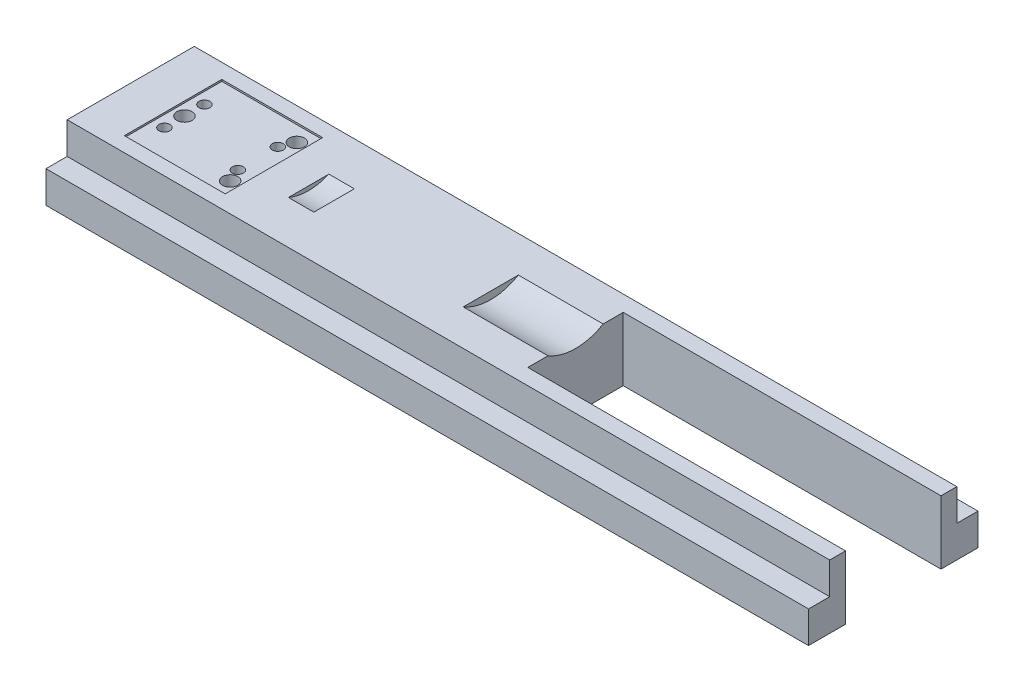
from build123d import *

# Parameters (mm, degrees)
SKETCH1_W           = 228.6
SKETCH1_H           = 50.8
BOSS_EXTRUDE1_DEPTH = 19.05
SKETCH2_W           = 30.226
SKETCH2_H           = 29.21
CUT_EXTRUDE1_DEPTH  = 0.508
SKETCH3_R           = 2.286
SKETCH3_R_2         = 1.651
CUT_EXTRUDE2_DEPTH  = 235.909356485
CUT_EXTRUDE3_START  = -19.05
SKETCH5_R           = 16.256
CUT_EXTRUDE3_DEPTH  = 101.6
SKETCH6_W           = 6.35
SKETCH6_H           = 9.525
CUT_EXTRUDE4_DEPTH  = 235.95
SKETCH7_W           = 28.6004
SKETCH7_H           = 19.05
CUT_EXTRUDE5_DEPTH  = 95.25
CUT_EXTRUDE6_START  = -167.64
SKETCH8_R           = 15.2527
CUT_EXTRUDE6_DEPTH  = 7.62
SKETCH9_W           = 39.7002
SKETCH9_H           = 34.9504
CUT_EXTRUDE7_DEPTH  = 3.9624


with BuildPart() as part:
    # Sketch1 → Boss-Extrude1 (new body)
    with BuildSketch(Plane(origin=(0, 0, 0), x_dir=(1, 0, 0), z_dir=(0, 1, 0))):
        with Locations((114.3, -25.4)):
            Rectangle(SKETCH1_W, SKETCH1_H)
    extrude(amount=-BOSS_EXTRUDE1_DEPTH)

    # Sketch2 → Cut-Extrude1 (cut)
    with BuildSketch(Plane(origin=(0, 0, 0), x_dir=(1, 0, 0), z_dir=(0, 1, 0))):
        with Locations((27.813, -25.4)):
            Rectangle(SKETCH2_W, SKETCH2_H)
    extrude(amount=-CUT_EXTRUDE1_DEPTH, mode=Mode.SUBTRACT)

    # Sketch3 → Cut-Extrude2 (cut, through all)
    with BuildSketch(Plane(origin=(0, -0.508, 0), x_dir=(1, 0, 0), z_dir=(0, 1, 0))):
        with Locations(Location((16.1036, -25.4, 0), (0, 0, 270))):
            Circle(SKETCH3_R)
        with Locations(Location((16.1036, -19.4056, 0), (0, 0, 270))):
            Circle(SKETCH3_R_2)
        with Locations(Location((16.1036, -31.3944, 0), (0, 0, 270))):
            Circle(SKETCH3_R_2)
        with Locations(Location((39.8018, -15.4051, 0), (0, 0, 270))):
            Circle(SKETCH3_R)
        with Locations(Location((39.8018, -35.3949, 0), (0, 0, 270))):
            Circle(SKETCH3_R)
        with Locations(Location((38.1, -19.4056, 0), (0, 0, 270))):
            Circle(SKETCH3_R_2)
        with Locations(Location((38.1, -31.3944, 0), (0, 0, 270))):
            Circle(SKETCH3_R_2)
    extrude(amount=-CUT_EXTRUDE2_DEPTH, mode=Mode.SUBTRACT)

    # Sketch5 → Cut-Extrude3 (cut)
    with BuildSketch(Plane(origin=(228.6, 0, 0), x_dir=(0, 0, -1), z_dir=(1, 0, 0)).offset(CUT_EXTRUDE3_START)):
        with Locations((-25.4, 13.9954)):
            Circle(SKETCH5_R)
    extrude(amount=-CUT_EXTRUDE3_DEPTH, mode=Mode.SUBTRACT)

    # Sketch6 → Cut-Extrude4 (cut, through all)
    with BuildSketch(Plane(origin=(228.6, 0, 0), x_dir=(0, 0, -1), z_dir=(1, 0, 0))):
        with Locations((-47.625, -4.7625)):
            Rectangle(SKETCH6_W, SKETCH6_H)
        with Locations((-3.175, -4.7625)):
            Rectangle(SKETCH6_W, SKETCH6_H)
    extrude(amount=-CUT_EXTRUDE4_DEPTH, mode=Mode.SUBTRACT)

    # Sketch7 → Cut-Extrude5 (cut)
    with BuildSketch(Plane(origin=(228.6, 0, 0), x_dir=(0, 0, -1), z_dir=(1, 0, 0))):
        with Locations((-25.4, -9.525)):
            Rectangle(SKETCH7_W, SKETCH7_H)
    extrude(amount=-CUT_EXTRUDE5_DEPTH, mode=Mode.SUBTRACT)

    # Sketch8 → Cut-Extrude6 (cut)
    with BuildSketch(Plane(origin=(228.6, 0, 0), x_dir=(0, 0, -1), z_dir=(1, 0, 0)).offset(CUT_EXTRUDE6_START)):
        with Locations((-25.4, 13.9954)):
            Circle(SKETCH8_R)
    extrude(amount=-CUT_EXTRUDE6_DEPTH, mode=Mode.SUBTRACT)

    # Sketch9 → Cut-Extrude7 (cut)
    with BuildSketch(Plane.XZ.offset(19.05)):
        with Locations((27.7749, 25.4)):
            Rectangle(SKETCH9_W, SKETCH9_H)
    extrude(amount=-CUT_EXTRUDE7_DEPTH, mode=Mode.SUBTRACT)


solid = part.part
